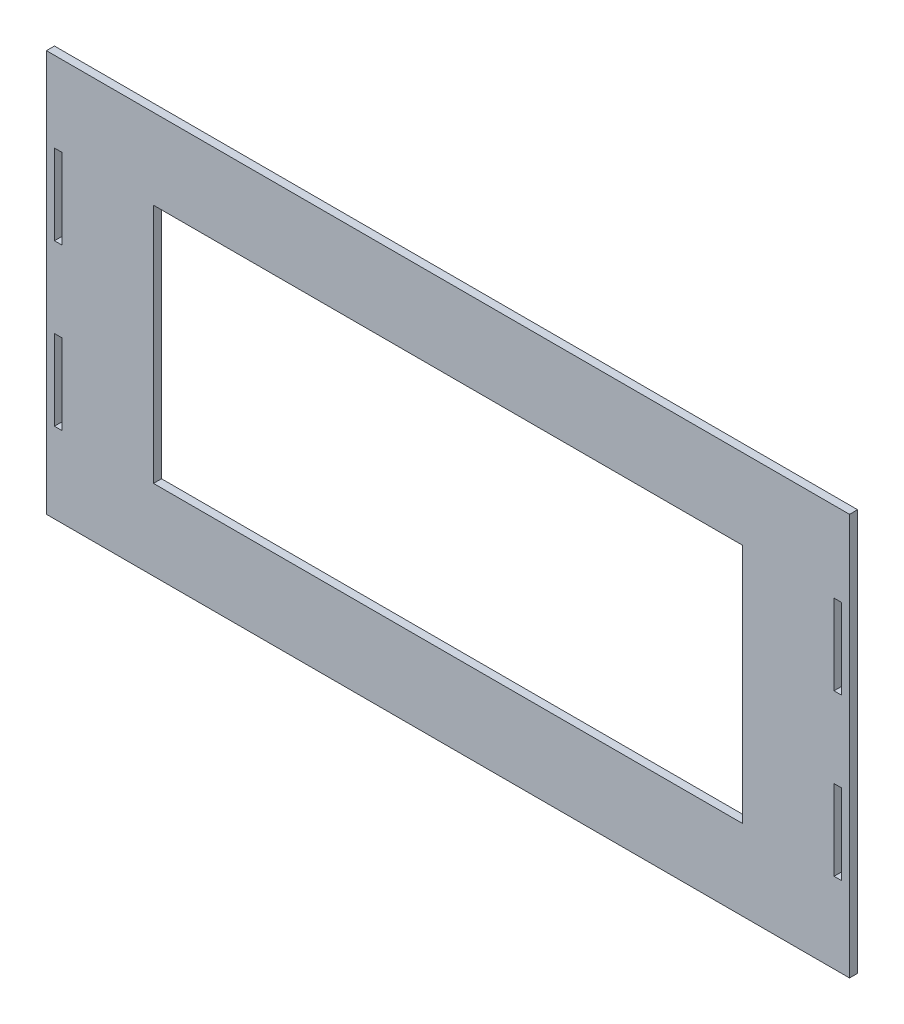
from build123d import *

# Parameters (mm, degrees)
CROQUIS1_W              = 300
CROQUIS1_H              = 150
CROQUIS1_W_2            = 220
CROQUIS1_H_2            = 90
CROQUIS1_W_3            = 2.8
CROQUIS1_H_3            = 30
SALIENTE_EXTRUIR1_DEPTH = 3


with BuildPart() as part:
    # Croquis1 → Saliente-Extruir1 (new body)
    with BuildSketch(Plane.XY):
        Rectangle(CROQUIS1_W, CROQUIS1_H)
        Rectangle(CROQUIS1_W_2, CROQUIS1_H_2, mode=Mode.SUBTRACT)
        with Locations((-145.6, 30)):
            Rectangle(CROQUIS1_W_3, CROQUIS1_H_3, mode=Mode.SUBTRACT)
        with Locations((-145.6, -30)):
            Rectangle(CROQUIS1_W_3, CROQUIS1_H_3, mode=Mode.SUBTRACT)
        with Locations((145.6, -30)):
            Rectangle(CROQUIS1_W_3, CROQUIS1_H_3, mode=Mode.SUBTRACT)
        with Locations((145.6, 30)):
            Rectangle(CROQUIS1_W_3, CROQUIS1_H_3, mode=Mode.SUBTRACT)
    extrude(amount=SALIENTE_EXTRUIR1_DEPTH)


solid = part.part
